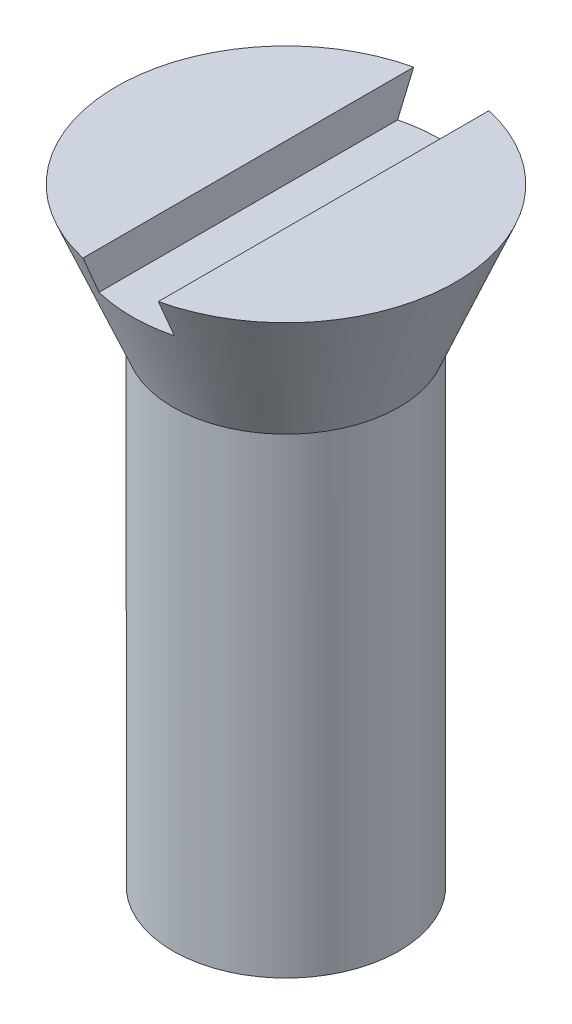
ISO-10303-21;
HEADER;
FILE_DESCRIPTION(('STEP AP214'),'2;1');
FILE_NAME('part.step','',(''),(''),'','','');
FILE_SCHEMA(('AUTOMOTIVE_DESIGN { 1 0 10303 214 1 1 1 1 }'));
ENDSEC;
DATA;
#1=APPLICATION_CONTEXT('core data for automotive mechanical design processes');
#2=APPLICATION_PROTOCOL_DEFINITION('international standard','automotive_design',2000,#1);
#3=PRODUCT_CONTEXT('',#1,'mechanical');
#4=PRODUCT('Part','Part','',(#3));
#5=PRODUCT_RELATED_PRODUCT_CATEGORY('part','',(#4));
#6=PRODUCT_DEFINITION_FORMATION('','',#4);
#7=PRODUCT_DEFINITION_CONTEXT('part definition',#1,'design');
#8=PRODUCT_DEFINITION('design','',#6,#7);
#9=PRODUCT_DEFINITION_SHAPE('','',#8);
#10=(LENGTH_UNIT() NAMED_UNIT(*) SI_UNIT(.MILLI.,.METRE.));
#11=(NAMED_UNIT(*) PLANE_ANGLE_UNIT() SI_UNIT($,.RADIAN.));
#12=(NAMED_UNIT(*) SI_UNIT($,.STERADIAN.) SOLID_ANGLE_UNIT());
#13=UNCERTAINTY_MEASURE_WITH_UNIT(LENGTH_MEASURE(1.E-05),#10,'distance_accuracy_value','');
#14=(GEOMETRIC_REPRESENTATION_CONTEXT(3) GLOBAL_UNCERTAINTY_ASSIGNED_CONTEXT((#13)) GLOBAL_UNIT_ASSIGNED_CONTEXT((#10,
#11,#12)) REPRESENTATION_CONTEXT('',''));
#15=CARTESIAN_POINT('',(0.,0.,0.));
#16=DIRECTION('',(0.,0.,1.));
#17=DIRECTION('',(1.,0.,0.));
#18=AXIS2_PLACEMENT_3D('',#15,#16,#17);
#19=CARTESIAN_POINT('',(-4.49999999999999,17.8533711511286,0.));
#20=DIRECTION('',(0.,-1.,0.));
#21=DIRECTION('',(0.,0.,-1.));
#22=AXIS2_PLACEMENT_3D('',#19,#20,#21);
#23=PLANE('',#22);
#24=CARTESIAN_POINT('',(0.,17.8533711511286,0.));
#25=DIRECTION('',(0.,-1.,0.));
#26=DIRECTION('',(0.,0.,-1.));
#27=AXIS2_PLACEMENT_3D('',#24,#25,#26);
#28=CIRCLE('',#27,4.5);
#29=CARTESIAN_POINT('',(-0.999999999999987,17.8533711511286,4.38748219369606));
#30=VERTEX_POINT('',#29);
#31=CARTESIAN_POINT('',(-1.,17.8533711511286,-4.38748219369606));
#32=VERTEX_POINT('',#31);
#33=EDGE_CURVE('E83',#30,#32,#28,.T.);
#34=ORIENTED_EDGE('',*,*,#33,.F.);
#35=DIRECTION('',(0.,0.,1.));
#36=VECTOR('',#35,1.);
#37=CARTESIAN_POINT('',(-0.999999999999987,17.8533711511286,-6.95722918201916));
#38=LINE('',#37,#36);
#39=EDGE_CURVE('E76',#32,#30,#38,.T.);
#40=ORIENTED_EDGE('',*,*,#39,.F.);
#41=EDGE_LOOP('',(#34,#40));
#42=FACE_BOUND('',#41,.T.);
#43=ADVANCED_FACE('F31',(#42),#23,.F.);
#44=CARTESIAN_POINT('',(1.00000000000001,17.8533711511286,-4.38748219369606));
#45=VERTEX_POINT('',#44);
#46=CARTESIAN_POINT('',(1.,17.8533711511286,4.38748219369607));
#47=VERTEX_POINT('',#46);
#48=EDGE_CURVE('E90',#45,#47,#28,.T.);
#49=ORIENTED_EDGE('',*,*,#48,.F.);
#50=DIRECTION('',(0.,0.,-1.));
#51=VECTOR('',#50,1.);
#52=CARTESIAN_POINT('',(1.,17.8533711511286,-6.95722918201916));
#53=LINE('',#52,#51);
#54=EDGE_CURVE('E84',#47,#45,#53,.T.);
#55=ORIENTED_EDGE('',*,*,#54,.F.);
#56=EDGE_LOOP('',(#49,#55));
#57=FACE_BOUND('',#56,.T.);
#58=ADVANCED_FACE('F33',(#57),#23,.F.);
#59=CARTESIAN_POINT('',(0.,17.8533711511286,0.));
#60=DIRECTION('',(0.,1.,0.));
#61=DIRECTION('',(0.,0.,1.));
#62=AXIS2_PLACEMENT_3D('',#59,#60,#61);
#63=CONICAL_SURFACE('',#62,4.5,0.392699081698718);
#64=ORIENTED_EDGE('',*,*,#33,.T.);
#65=CARTESIAN_POINT('',(-1.,22.6214359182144,-6.39731094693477));
#66=CARTESIAN_POINT('',(-0.999999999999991,22.1576269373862,-6.20285005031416));
#67=CARTESIAN_POINT('',(-0.999999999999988,21.6938851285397,-6.00822851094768));
#68=CARTESIAN_POINT('',(-0.999999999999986,20.7666112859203,-5.61850468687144));
#69=CARTESIAN_POINT('',(-0.999999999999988,20.3030792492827,-5.42340240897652));
#70=CARTESIAN_POINT('',(-0.999999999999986,19.3763281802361,-5.03256941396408));
#71=CARTESIAN_POINT('',(-0.999999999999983,18.9131091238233,-4.83683875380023));
#72=CARTESIAN_POINT('',(-0.999999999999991,17.9870554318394,-4.44445071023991));
#73=CARTESIAN_POINT('',(-1.,17.5242208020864,-4.24779331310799));
#74=CARTESIAN_POINT('',(-1.,16.5990672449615,-3.85308326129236));
#75=CARTESIAN_POINT('',(-0.999999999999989,16.1367484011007,-3.65503041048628));
#76=CARTESIAN_POINT('',(-0.999999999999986,15.4439907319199,-3.35630307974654));
#77=CARTESIAN_POINT('',(-0.999999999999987,15.2131958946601,-3.25645449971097));
#78=CARTESIAN_POINT('',(-0.999999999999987,14.7519202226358,-3.05602901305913));
#79=CARTESIAN_POINT('',(-0.999999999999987,14.5214393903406,-2.95545210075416));
#80=CARTESIAN_POINT('',(-0.999999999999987,14.0608733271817,-2.75331074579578));
#81=CARTESIAN_POINT('',(-0.999999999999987,13.8307881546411,-2.65174617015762));
#82=CARTESIAN_POINT('',(-0.999999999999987,13.3712205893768,-2.44727167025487));
#83=CARTESIAN_POINT('',(-0.999999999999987,13.1417381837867,-2.34436177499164));
#84=CARTESIAN_POINT('',(-0.999999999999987,12.798168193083,-2.18851526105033));
#85=CARTESIAN_POINT('',(-0.999999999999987,12.6837462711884,-2.13631598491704));
#86=CARTESIAN_POINT('',(-0.999999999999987,12.4551844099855,-2.03130559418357));
#87=CARTESIAN_POINT('',(-0.999999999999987,12.3410444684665,-1.97849448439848));
#88=CARTESIAN_POINT('',(-0.999999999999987,12.113110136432,-1.87210843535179));
#89=CARTESIAN_POINT('',(-0.999999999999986,11.9993157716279,-1.81853344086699));
#90=CARTESIAN_POINT('',(-0.999999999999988,11.7721971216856,-1.71038916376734));
#91=CARTESIAN_POINT('',(-0.999999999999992,11.6588728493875,-1.6558198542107));
#92=CARTESIAN_POINT('',(-1.,11.5458448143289,-1.60063772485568));
#93=B_SPLINE_CURVE_WITH_KNOTS('',3,(#65,#66,#67,#68,#69,#70,#71,#72,#73,#74,#75,#76,#77,#78,#79,
#80,#81,#82,#83,#84,#85,#86,#87,#88,#89,#90,#91,#92),.UNSPECIFIED.,.F.,.F.,(4,2,2,2,2,2,2,2,2,2,
2,2,2,4),(0.,1.50877597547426,3.01753068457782,4.52615230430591,6.03479635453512,
7.54365684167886,8.29805902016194,9.05246709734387,9.80697819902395,10.5614730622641,
10.9387702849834,11.3160645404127,11.6933862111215,12.0707181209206),.UNSPECIFIED.);
#94=CARTESIAN_POINT('',(-1.,16.8533711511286,-3.96152127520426));
#95=VERTEX_POINT('',#94);
#96=EDGE_CURVE('E11',#32,#95,#93,.T.);
#97=ORIENTED_EDGE('',*,*,#96,.T.);
#98=CARTESIAN_POINT('',(0.,16.8533711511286,0.));
#99=DIRECTION('',(0.,1.,0.));
#100=DIRECTION('',(0.,0.,1.));
#101=AXIS2_PLACEMENT_3D('',#98,#99,#100);
#102=CIRCLE('',#101,4.08578643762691);
#103=CARTESIAN_POINT('',(1.00000000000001,16.8533711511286,-3.96152127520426));
#104=VERTEX_POINT('',#103);
#105=EDGE_CURVE('E102',#104,#95,#102,.T.);
#106=ORIENTED_EDGE('',*,*,#105,.F.);
#107=CARTESIAN_POINT('',(1.,11.5458448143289,-1.60063772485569));
#108=CARTESIAN_POINT('',(1.,11.6481100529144,-1.65057142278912));
#109=CARTESIAN_POINT('',(1.,11.7506210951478,-1.69999701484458));
#110=CARTESIAN_POINT('',(1.,11.9560382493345,-1.7980149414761));
#111=CARTESIAN_POINT('',(1.,12.0589443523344,-1.84660729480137));
#112=CARTESIAN_POINT('',(1.,12.3681038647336,-1.99140591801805));
#113=CARTESIAN_POINT('',(1.,12.5748119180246,-2.08664025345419));
#114=CARTESIAN_POINT('',(1.,12.9889873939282,-2.27536549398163));
#115=CARTESIAN_POINT('',(1.,13.1964547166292,-2.36885661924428));
#116=CARTESIAN_POINT('',(1.,13.6119416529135,-2.55461331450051));
#117=CARTESIAN_POINT('',(1.,13.8199612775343,-2.64687885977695));
#118=CARTESIAN_POINT('',(1.,14.2801724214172,-2.84981541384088));
#119=CARTESIAN_POINT('',(1.,14.53245586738,-2.96027771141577));
#120=CARTESIAN_POINT('',(1.,15.0374317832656,-3.18025742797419));
#121=CARTESIAN_POINT('',(1.,15.2901242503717,-3.28977485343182));
#122=CARTESIAN_POINT('',(1.,16.0486895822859,-3.61730866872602));
#123=CARTESIAN_POINT('',(1.00000000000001,16.5550096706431,-3.83428875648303));
#124=CARTESIAN_POINT('',(1.00000000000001,17.524281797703,-4.24781720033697));
#125=CARTESIAN_POINT('',(1.,17.9871760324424,-4.44450138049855));
#126=CARTESIAN_POINT('',(0.999999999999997,18.9133568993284,-4.83694417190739));
#127=CARTESIAN_POINT('',(1.,19.3766435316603,-5.03270278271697));
#128=CARTESIAN_POINT('',(1.,20.3034022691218,-5.42353825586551));
#129=CARTESIAN_POINT('',(1.,20.7668743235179,-5.61861523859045));
#130=CARTESIAN_POINT('',(1.,21.6940204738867,-6.00828539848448));
#131=CARTESIAN_POINT('',(1.,22.157694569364,-6.20287857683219));
#132=CARTESIAN_POINT('',(1.,22.6214359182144,-6.39731094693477));
#133=B_SPLINE_CURVE_WITH_KNOTS('',3,(#107,#108,#109,#110,#111,#112,#113,#114,#115,#116,#117,
#118,#119,#120,#121,#122,#123,#124,#125,#126,#127,#128,#129,#130,#131,#132),.UNSPECIFIED.,.F.,
.F.,(4,2,2,2,2,2,2,2,2,2,2,2,4),(0.,0.341410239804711,0.682812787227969,1.36557309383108,
2.04824657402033,2.73093380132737,3.55715118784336,4.38336290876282,6.03591968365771,
7.54475991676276,9.05360086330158,10.5621602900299,12.0707160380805),.UNSPECIFIED.);
#134=EDGE_CURVE('E43',#104,#45,#133,.T.);
#135=ORIENTED_EDGE('',*,*,#134,.T.);
#136=ORIENTED_EDGE('',*,*,#48,.T.);
#137=CARTESIAN_POINT('',(1.00000000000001,22.6214359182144,6.39731094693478));
#138=CARTESIAN_POINT('',(1.00000000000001,22.1576269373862,6.20285005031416));
#139=CARTESIAN_POINT('',(1.,21.6938851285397,6.00822851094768));
#140=CARTESIAN_POINT('',(1.,20.7666112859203,5.61850468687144));
#141=CARTESIAN_POINT('',(1.,20.3030792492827,5.42340240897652));
#142=CARTESIAN_POINT('',(1.,19.3763281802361,5.03256941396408));
#143=CARTESIAN_POINT('',(1.,18.9131091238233,4.83683875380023));
#144=CARTESIAN_POINT('',(1.,17.9870554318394,4.44445071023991));
#145=CARTESIAN_POINT('',(1.,17.5242208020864,4.24779331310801));
#146=CARTESIAN_POINT('',(1.,16.5990672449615,3.85308326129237));
#147=CARTESIAN_POINT('',(1.,16.1367484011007,3.65503041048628));
#148=CARTESIAN_POINT('',(1.,15.4439907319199,3.35630307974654));
#149=CARTESIAN_POINT('',(1.,15.2131958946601,3.25645449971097));
#150=CARTESIAN_POINT('',(1.,14.7519202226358,3.05602901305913));
#151=CARTESIAN_POINT('',(1.,14.5214393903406,2.95545210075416));
#152=CARTESIAN_POINT('',(1.,14.0608733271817,2.75331074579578));
#153=CARTESIAN_POINT('',(1.,13.8307881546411,2.65174617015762));
#154=CARTESIAN_POINT('',(1.,13.3712205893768,2.44727167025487));
#155=CARTESIAN_POINT('',(1.,13.1417381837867,2.34436177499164));
#156=CARTESIAN_POINT('',(1.,12.798168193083,2.18851526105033));
#157=CARTESIAN_POINT('',(1.,12.6837462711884,2.13631598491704));
#158=CARTESIAN_POINT('',(1.,12.4551844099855,2.03130559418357));
#159=CARTESIAN_POINT('',(1.,12.3410444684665,1.97849448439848));
#160=CARTESIAN_POINT('',(1.,12.113110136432,1.87210843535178));
#161=CARTESIAN_POINT('',(1.,11.9993157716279,1.81853344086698));
#162=CARTESIAN_POINT('',(1.,11.7721971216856,1.71038916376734));
#163=CARTESIAN_POINT('',(1.00000000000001,11.6588728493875,1.65581985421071));
#164=CARTESIAN_POINT('',(1.00000000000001,11.5458448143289,1.6006377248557));
#165=B_SPLINE_CURVE_WITH_KNOTS('',3,(#137,#138,#139,#140,#141,#142,#143,#144,#145,#146,#147,
#148,#149,#150,#151,#152,#153,#154,#155,#156,#157,#158,#159,#160,#161,#162,#163,#164),
.UNSPECIFIED.,.F.,.F.,(4,2,2,2,2,2,2,2,2,2,2,2,2,4),(0.,1.50877597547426,3.01753068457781,
4.52615230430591,6.03479635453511,7.54365684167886,8.29805902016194,9.05246709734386,
9.80697819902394,10.5614730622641,10.9387702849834,11.3160645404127,11.6933862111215,
12.0707181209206),.UNSPECIFIED.);
#166=CARTESIAN_POINT('',(1.,16.8533711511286,3.96152127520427));
#167=VERTEX_POINT('',#166);
#168=EDGE_CURVE('E101',#47,#167,#165,.T.);
#169=ORIENTED_EDGE('',*,*,#168,.T.);
#170=CARTESIAN_POINT('',(-1.,16.8533711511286,3.96152127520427));
#171=VERTEX_POINT('',#170);
#172=EDGE_CURVE('E94',#171,#167,#102,.T.);
#173=ORIENTED_EDGE('',*,*,#172,.F.);
#174=CARTESIAN_POINT('',(-1.,11.5458448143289,1.6006377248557));
#175=CARTESIAN_POINT('',(-0.999999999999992,11.6481100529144,1.65057142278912));
#176=CARTESIAN_POINT('',(-0.999999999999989,11.7506210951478,1.69999701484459));
#177=CARTESIAN_POINT('',(-0.999999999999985,11.9560382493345,1.79801494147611));
#178=CARTESIAN_POINT('',(-0.999999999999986,12.0589443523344,1.84660729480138));
#179=CARTESIAN_POINT('',(-0.999999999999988,12.3681038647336,1.99140591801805));
#180=CARTESIAN_POINT('',(-0.999999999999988,12.5748119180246,2.08664025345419));
#181=CARTESIAN_POINT('',(-0.999999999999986,12.9889873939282,2.27536549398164));
#182=CARTESIAN_POINT('',(-0.999999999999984,13.1964547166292,2.36885661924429));
#183=CARTESIAN_POINT('',(-0.99999999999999,13.6119416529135,2.55461331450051));
#184=CARTESIAN_POINT('',(-1.,13.8199612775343,2.64687885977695));
#185=CARTESIAN_POINT('',(-1.,14.2801724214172,2.84981541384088));
#186=CARTESIAN_POINT('',(-0.999999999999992,14.53245586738,2.96027771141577));
#187=CARTESIAN_POINT('',(-0.999999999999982,15.0374317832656,3.1802574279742));
#188=CARTESIAN_POINT('',(-0.999999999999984,15.2901242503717,3.28977485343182));
#189=CARTESIAN_POINT('',(-0.999999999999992,16.0486895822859,3.61730866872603));
#190=CARTESIAN_POINT('',(-1.,16.5550096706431,3.83428875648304));
#191=CARTESIAN_POINT('',(-1.,17.524281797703,4.24781720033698));
#192=CARTESIAN_POINT('',(-0.99999999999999,17.9871760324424,4.44450138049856));
#193=CARTESIAN_POINT('',(-0.999999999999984,18.9133568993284,4.8369441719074));
#194=CARTESIAN_POINT('',(-0.999999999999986,19.3766435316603,5.03270278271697));
#195=CARTESIAN_POINT('',(-0.999999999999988,20.3034022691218,5.42353825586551));
#196=CARTESIAN_POINT('',(-0.999999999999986,20.7668743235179,5.61861523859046));
#197=CARTESIAN_POINT('',(-0.999999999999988,21.6940204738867,6.00828539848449));
#198=CARTESIAN_POINT('',(-0.999999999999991,22.157694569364,6.2028785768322));
#199=CARTESIAN_POINT('',(-1.,22.6214359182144,6.39731094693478));
#200=B_SPLINE_CURVE_WITH_KNOTS('',3,(#174,#175,#176,#177,#178,#179,#180,#181,#182,#183,#184,
#185,#186,#187,#188,#189,#190,#191,#192,#193,#194,#195,#196,#197,#198,#199),.UNSPECIFIED.,.F.,
.F.,(4,2,2,2,2,2,2,2,2,2,2,2,4),(0.,0.341410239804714,0.682812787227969,1.36557309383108,
2.04824657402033,2.73093380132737,3.55715118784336,4.38336290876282,6.03591968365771,
7.54475991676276,9.05360086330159,10.5621602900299,12.0707160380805),.UNSPECIFIED.);
#201=EDGE_CURVE('E89',#171,#30,#200,.T.);
#202=ORIENTED_EDGE('',*,*,#201,.T.);
#203=EDGE_LOOP('',(#64,#97,#106,#135,#136,#169,#173,#202));
#204=FACE_BOUND('',#203,.T.);
#205=CARTESIAN_POINT('',(0.,14.2320508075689,0.));
#206=DIRECTION('',(0.,-1.,0.));
#207=DIRECTION('',(0.,0.,-1.));
#208=AXIS2_PLACEMENT_3D('',#205,#206,#207);
#209=CIRCLE('',#208,3.);
#210=CARTESIAN_POINT('',(0.,14.2320508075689,-2.99999999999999));
#211=VERTEX_POINT('',#210);
#212=EDGE_CURVE('E91',#211,#211,#209,.T.);
#213=ORIENTED_EDGE('',*,*,#212,.F.);
#214=EDGE_LOOP('',(#213));
#215=FACE_BOUND('',#214,.T.);
#216=ADVANCED_FACE('F86',(#204,#215),#63,.T.);
#217=CARTESIAN_POINT('',(0.,0.,0.));
#218=DIRECTION('',(0.,-1.,0.));
#219=DIRECTION('',(0.,0.,-1.));
#220=AXIS2_PLACEMENT_3D('',#217,#218,#219);
#221=CYLINDRICAL_SURFACE('',#220,3.);
#222=CARTESIAN_POINT('',(0.,1.73205080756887,0.));
#223=DIRECTION('',(0.,-1.,0.));
#224=DIRECTION('',(0.,0.,-1.));
#225=AXIS2_PLACEMENT_3D('',#222,#223,#224);
#226=CIRCLE('',#225,3.);
#227=CARTESIAN_POINT('',(0.,1.73205080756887,-2.99999999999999));
#228=VERTEX_POINT('',#227);
#229=EDGE_CURVE('E96',#228,#228,#226,.T.);
#230=ORIENTED_EDGE('',*,*,#229,.F.);
#231=EDGE_LOOP('',(#230));
#232=FACE_BOUND('',#231,.T.);
#233=ORIENTED_EDGE('',*,*,#212,.T.);
#234=EDGE_LOOP('',(#233));
#235=FACE_BOUND('',#234,.T.);
#236=ADVANCED_FACE('F142',(#232,#235),#221,.T.);
#237=CARTESIAN_POINT('',(0.,1.73205080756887,0.));
#238=DIRECTION('',(0.,1.,0.));
#239=DIRECTION('',(0.,0.,1.));
#240=AXIS2_PLACEMENT_3D('',#237,#238,#239);
#241=CONICAL_SURFACE('',#240,3.,1.0471975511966);
#242=CARTESIAN_POINT('',(0.,0.,0.));
#243=VERTEX_POINT('',#242);
#244=VERTEX_LOOP('',#243);
#245=FACE_BOUND('',#244,.T.);
#246=ORIENTED_EDGE('',*,*,#229,.T.);
#247=EDGE_LOOP('',(#246));
#248=FACE_BOUND('',#247,.T.);
#249=ADVANCED_FACE('F149',(#245,#248),#241,.T.);
#250=CARTESIAN_POINT('',(-0.999999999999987,16.8533711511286,-6.95722918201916));
#251=DIRECTION('',(-1.,0.,0.));
#252=DIRECTION('',(0.,0.,1.));
#253=AXIS2_PLACEMENT_3D('',#250,#251,#252);
#254=PLANE('',#253);
#255=ORIENTED_EDGE('',*,*,#39,.T.);
#256=ORIENTED_EDGE('',*,*,#201,.F.);
#257=DIRECTION('',(0.,0.,1.));
#258=VECTOR('',#257,1.);
#259=CARTESIAN_POINT('',(-0.999999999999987,16.8533711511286,-6.95722918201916));
#260=LINE('',#259,#258);
#261=EDGE_CURVE('E50',#95,#171,#260,.T.);
#262=ORIENTED_EDGE('',*,*,#261,.F.);
#263=ORIENTED_EDGE('',*,*,#96,.F.);
#264=EDGE_LOOP('',(#255,#256,#262,#263));
#265=FACE_BOUND('',#264,.T.);
#266=ADVANCED_FACE('F75',(#265),#254,.F.);
#267=CARTESIAN_POINT('',(1.,16.8533711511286,-6.95722918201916));
#268=DIRECTION('',(1.,0.,0.));
#269=DIRECTION('',(0.,0.,-1.));
#270=AXIS2_PLACEMENT_3D('',#267,#268,#269);
#271=PLANE('',#270);
#272=DIRECTION('',(0.,0.,-1.));
#273=VECTOR('',#272,1.);
#274=CARTESIAN_POINT('',(1.,16.8533711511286,-6.95722918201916));
#275=LINE('',#274,#273);
#276=EDGE_CURVE('E130',#167,#104,#275,.T.);
#277=ORIENTED_EDGE('',*,*,#276,.F.);
#278=ORIENTED_EDGE('',*,*,#168,.F.);
#279=ORIENTED_EDGE('',*,*,#54,.T.);
#280=ORIENTED_EDGE('',*,*,#134,.F.);
#281=EDGE_LOOP('',(#277,#278,#279,#280));
#282=FACE_BOUND('',#281,.T.);
#283=ADVANCED_FACE('F114',(#282),#271,.F.);
#284=CARTESIAN_POINT('',(-1.,16.8533711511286,6.95722918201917));
#285=DIRECTION('',(0.,1.,0.));
#286=DIRECTION('',(0.,0.,1.));
#287=AXIS2_PLACEMENT_3D('',#284,#285,#286);
#288=PLANE('',#287);
#289=ORIENTED_EDGE('',*,*,#105,.T.);
#290=ORIENTED_EDGE('',*,*,#261,.T.);
#291=ORIENTED_EDGE('',*,*,#172,.T.);
#292=ORIENTED_EDGE('',*,*,#276,.T.);
#293=EDGE_LOOP('',(#289,#290,#291,#292));
#294=FACE_BOUND('',#293,.T.);
#295=ADVANCED_FACE('F118',(#294),#288,.T.);
#296=CLOSED_SHELL('',(#43,#58,#216,#236,#249,#266,#283,#295));
#297=MANIFOLD_SOLID_BREP('B2',#296);
#298=ADVANCED_BREP_SHAPE_REPRESENTATION('',(#18,#297),#14);
#299=SHAPE_DEFINITION_REPRESENTATION(#9,#298);
ENDSEC;
END-ISO-10303-21;
